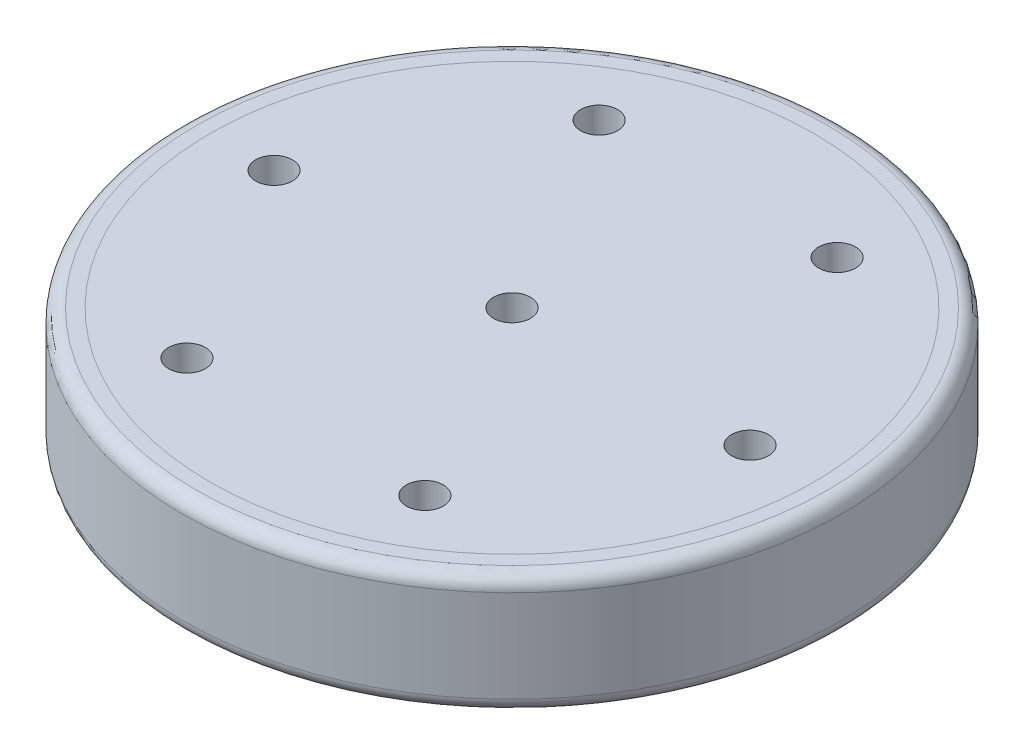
ISO-10303-21;
HEADER;
FILE_DESCRIPTION(('STEP AP214'),'2;1');
FILE_NAME('part.step','',(''),(''),'','','');
FILE_SCHEMA(('AUTOMOTIVE_DESIGN { 1 0 10303 214 1 1 1 1 }'));
ENDSEC;
DATA;
#1=APPLICATION_CONTEXT('core data for automotive mechanical design processes');
#2=APPLICATION_PROTOCOL_DEFINITION('international standard','automotive_design',2000,#1);
#3=PRODUCT_CONTEXT('',#1,'mechanical');
#4=PRODUCT('Part','Part','',(#3));
#5=PRODUCT_RELATED_PRODUCT_CATEGORY('part','',(#4));
#6=PRODUCT_DEFINITION_FORMATION('','',#4);
#7=PRODUCT_DEFINITION_CONTEXT('part definition',#1,'design');
#8=PRODUCT_DEFINITION('design','',#6,#7);
#9=PRODUCT_DEFINITION_SHAPE('','',#8);
#10=(LENGTH_UNIT() NAMED_UNIT(*) SI_UNIT(.MILLI.,.METRE.));
#11=(NAMED_UNIT(*) PLANE_ANGLE_UNIT() SI_UNIT($,.RADIAN.));
#12=(NAMED_UNIT(*) SI_UNIT($,.STERADIAN.) SOLID_ANGLE_UNIT());
#13=UNCERTAINTY_MEASURE_WITH_UNIT(LENGTH_MEASURE(1.E-05),#10,'distance_accuracy_value','');
#14=(GEOMETRIC_REPRESENTATION_CONTEXT(3) GLOBAL_UNCERTAINTY_ASSIGNED_CONTEXT((#13)) GLOBAL_UNIT_ASSIGNED_CONTEXT((#10,
#11,#12)) REPRESENTATION_CONTEXT('',''));
#15=CARTESIAN_POINT('',(0.,0.,0.));
#16=DIRECTION('',(0.,0.,1.));
#17=DIRECTION('',(1.,0.,0.));
#18=AXIS2_PLACEMENT_3D('',#15,#16,#17);
#19=CARTESIAN_POINT('',(0.,-10.,0.));
#20=DIRECTION('',(0.,1.,0.));
#21=DIRECTION('',(0.,0.,1.));
#22=AXIS2_PLACEMENT_3D('',#19,#20,#21);
#23=CYLINDRICAL_SURFACE('',#22,35.75);
#24=CARTESIAN_POINT('',(0.,-8.5,0.));
#25=DIRECTION('',(0.,1.,0.));
#26=DIRECTION('',(0.,0.,1.));
#27=AXIS2_PLACEMENT_3D('',#24,#25,#26);
#28=CIRCLE('',#27,35.75);
#29=CARTESIAN_POINT('',(0.,-8.5,35.75));
#30=VERTEX_POINT('',#29);
#31=EDGE_CURVE('E53',#30,#30,#28,.T.);
#32=CARTESIAN_POINT('',(0.,1.5,0.));
#33=DIRECTION('',(0.,1.,0.));
#34=DIRECTION('',(0.,0.,1.));
#35=AXIS2_PLACEMENT_3D('',#32,#33,#34);
#36=CIRCLE('',#35,35.75);
#37=CARTESIAN_POINT('',(0.,1.5,35.75));
#38=VERTEX_POINT('',#37);
#39=EDGE_CURVE('E57',#38,#38,#36,.F.);
#40=CARTESIAN_POINT('',(0.,-8.5,35.75));
#41=CARTESIAN_POINT('',(0.,-8.39583333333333,35.75));
#42=CARTESIAN_POINT('',(0.,-8.29166666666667,35.75));
#43=CARTESIAN_POINT('',(0.,-8.08333333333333,35.75));
#44=CARTESIAN_POINT('',(0.,-7.97916666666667,35.75));
#45=CARTESIAN_POINT('',(0.,-7.77083333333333,35.75));
#46=CARTESIAN_POINT('',(0.,-7.66666666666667,35.75));
#47=CARTESIAN_POINT('',(0.,-7.45833333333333,35.75));
#48=CARTESIAN_POINT('',(0.,-7.35416666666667,35.75));
#49=CARTESIAN_POINT('',(0.,-7.14583333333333,35.75));
#50=CARTESIAN_POINT('',(0.,-7.04166666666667,35.75));
#51=CARTESIAN_POINT('',(0.,-6.83333333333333,35.75));
#52=CARTESIAN_POINT('',(0.,-6.72916666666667,35.75));
#53=CARTESIAN_POINT('',(0.,-6.52083333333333,35.75));
#54=CARTESIAN_POINT('',(0.,-6.41666666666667,35.75));
#55=CARTESIAN_POINT('',(0.,-6.20833333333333,35.75));
#56=CARTESIAN_POINT('',(0.,-6.10416666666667,35.75));
#57=CARTESIAN_POINT('',(0.,-5.89583333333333,35.75));
#58=CARTESIAN_POINT('',(0.,-5.79166666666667,35.75));
#59=CARTESIAN_POINT('',(0.,-5.58333333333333,35.75));
#60=CARTESIAN_POINT('',(0.,-5.47916666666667,35.75));
#61=CARTESIAN_POINT('',(0.,-5.27083333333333,35.75));
#62=CARTESIAN_POINT('',(0.,-5.16666666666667,35.75));
#63=CARTESIAN_POINT('',(0.,-4.95833333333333,35.75));
#64=CARTESIAN_POINT('',(0.,-4.85416666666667,35.75));
#65=CARTESIAN_POINT('',(0.,-4.64583333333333,35.75));
#66=CARTESIAN_POINT('',(0.,-4.54166666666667,35.75));
#67=CARTESIAN_POINT('',(0.,-4.33333333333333,35.75));
#68=CARTESIAN_POINT('',(0.,-4.22916666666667,35.75));
#69=CARTESIAN_POINT('',(0.,-4.02083333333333,35.75));
#70=CARTESIAN_POINT('',(0.,-3.91666666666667,35.75));
#71=CARTESIAN_POINT('',(0.,-3.70833333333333,35.75));
#72=CARTESIAN_POINT('',(0.,-3.60416666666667,35.75));
#73=CARTESIAN_POINT('',(0.,-3.39583333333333,35.75));
#74=CARTESIAN_POINT('',(0.,-3.29166666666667,35.75));
#75=CARTESIAN_POINT('',(0.,-3.08333333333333,35.75));
#76=CARTESIAN_POINT('',(0.,-2.97916666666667,35.75));
#77=CARTESIAN_POINT('',(0.,-2.77083333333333,35.75));
#78=CARTESIAN_POINT('',(0.,-2.66666666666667,35.75));
#79=CARTESIAN_POINT('',(0.,-2.45833333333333,35.75));
#80=CARTESIAN_POINT('',(0.,-2.35416666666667,35.75));
#81=CARTESIAN_POINT('',(0.,-2.14583333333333,35.75));
#82=CARTESIAN_POINT('',(0.,-2.04166666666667,35.75));
#83=CARTESIAN_POINT('',(0.,-1.83333333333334,35.75));
#84=CARTESIAN_POINT('',(0.,-1.72916666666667,35.75));
#85=CARTESIAN_POINT('',(0.,-1.52083333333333,35.75));
#86=CARTESIAN_POINT('',(0.,-1.41666666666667,35.75));
#87=CARTESIAN_POINT('',(0.,-1.20833333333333,35.75));
#88=CARTESIAN_POINT('',(0.,-1.10416666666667,35.75));
#89=CARTESIAN_POINT('',(0.,-0.895833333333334,35.75));
#90=CARTESIAN_POINT('',(0.,-0.791666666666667,35.75));
#91=CARTESIAN_POINT('',(0.,-0.583333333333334,35.75));
#92=CARTESIAN_POINT('',(0.,-0.479166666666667,35.75));
#93=CARTESIAN_POINT('',(0.,-0.270833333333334,35.75));
#94=CARTESIAN_POINT('',(0.,-0.166666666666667,35.75));
#95=CARTESIAN_POINT('',(0.,0.0416666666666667,35.75));
#96=CARTESIAN_POINT('',(0.,0.145833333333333,35.75));
#97=CARTESIAN_POINT('',(0.,0.354166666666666,35.75));
#98=CARTESIAN_POINT('',(0.,0.458333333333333,35.75));
#99=CARTESIAN_POINT('',(0.,0.666666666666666,35.75));
#100=CARTESIAN_POINT('',(0.,0.770833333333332,35.75));
#101=CARTESIAN_POINT('',(0.,0.979166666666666,35.75));
#102=CARTESIAN_POINT('',(0.,1.08333333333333,35.75));
#103=CARTESIAN_POINT('',(0.,1.29166666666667,35.75));
#104=CARTESIAN_POINT('',(0.,1.39583333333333,35.75));
#105=CARTESIAN_POINT('',(0.,1.5,35.75));
#106=B_SPLINE_CURVE_WITH_KNOTS('',3,(#40,#41,#42,#43,#44,#45,#46,#47,#48,#49,#50,#51,#52,#53,
#54,#55,#56,#57,#58,#59,#60,#61,#62,#63,#64,#65,#66,#67,#68,#69,#70,#71,#72,#73,#74,#75,#76,#77,
#78,#79,#80,#81,#82,#83,#84,#85,#86,#87,#88,#89,#90,#91,#92,#93,#94,#95,#96,#97,#98,#99,#100,
#101,#102,#103,#104,#105),.UNSPECIFIED.,.F.,.F.,(4,2,2,2,2,2,2,2,2,2,2,2,2,2,2,2,2,2,2,2,2,2,2,
2,2,2,2,2,2,2,2,2,4),(0.,0.312499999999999,0.624999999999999,0.937499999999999,1.25,1.5625,
1.875,2.1875,2.5,2.8125,3.125,3.4375,3.75,4.0625,4.375,4.6875,5.,5.3125,5.625,5.9375,6.25,
6.5625,6.875,7.1875,7.5,7.8125,8.125,8.4375,8.75,9.0625,9.375,9.6875,10.),.UNSPECIFIED.);
#107=EDGE_CURVE('BSEAM45',#30,#38,#106,.T.);
#108=ORIENTED_EDGE('',*,*,#31,.T.);
#109=ORIENTED_EDGE('',*,*,#39,.T.);
#110=ORIENTED_EDGE('',*,*,#107,.T.);
#111=ORIENTED_EDGE('',*,*,#107,.F.);
#112=EDGE_LOOP('',(#108,#110,#109,#111));
#113=FACE_BOUND('',#112,.T.);
#114=ADVANCED_FACE('F45',(#113),#23,.T.);
#115=CARTESIAN_POINT('',(0.,3.,0.));
#116=DIRECTION('',(0.,1.,0.));
#117=DIRECTION('',(0.,0.,1.));
#118=AXIS2_PLACEMENT_3D('',#115,#116,#117);
#119=PLANE('',#118);
#120=CARTESIAN_POINT('',(0.,3.,0.));
#121=DIRECTION('',(0.,1.,0.));
#122=DIRECTION('',(0.,0.,1.));
#123=AXIS2_PLACEMENT_3D('',#120,#121,#122);
#124=CIRCLE('',#123,34.25);
#125=CARTESIAN_POINT('',(0.,3.,34.25));
#126=VERTEX_POINT('',#125);
#127=EDGE_CURVE('E12',#126,#126,#124,.T.);
#128=ORIENTED_EDGE('',*,*,#127,.T.);
#129=EDGE_LOOP('',(#128));
#130=FACE_BOUND('',#129,.T.);
#131=CARTESIAN_POINT('',(0.,3.,0.));
#132=DIRECTION('',(0.,1.,0.));
#133=DIRECTION('',(0.,0.,1.));
#134=AXIS2_PLACEMENT_3D('',#131,#132,#133);
#135=CIRCLE('',#134,32.75);
#136=CARTESIAN_POINT('',(0.,3.,32.75));
#137=VERTEX_POINT('',#136);
#138=EDGE_CURVE('E65',#137,#137,#135,.T.);
#139=ORIENTED_EDGE('',*,*,#138,.F.);
#140=EDGE_LOOP('',(#139));
#141=FACE_BOUND('',#140,.T.);
#142=ADVANCED_FACE('F85',(#130,#141),#119,.T.);
#143=CARTESIAN_POINT('',(0.,-10.,0.));
#144=DIRECTION('',(0.,1.,0.));
#145=DIRECTION('',(0.,0.,1.));
#146=AXIS2_PLACEMENT_3D('',#143,#144,#145);
#147=CYLINDRICAL_SURFACE('',#146,32.75);
#148=CARTESIAN_POINT('',(0.,-8.5,0.));
#149=DIRECTION('',(0.,1.,0.));
#150=DIRECTION('',(0.,0.,1.));
#151=AXIS2_PLACEMENT_3D('',#148,#149,#150);
#152=CIRCLE('',#151,32.75);
#153=CARTESIAN_POINT('',(0.,-8.5,32.75));
#154=VERTEX_POINT('',#153);
#155=EDGE_CURVE('E62',#154,#154,#152,.F.);
#156=CARTESIAN_POINT('',(0.,-8.5,32.75));
#157=CARTESIAN_POINT('',(0.,-8.38020833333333,32.75));
#158=CARTESIAN_POINT('',(0.,-8.26041666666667,32.75));
#159=CARTESIAN_POINT('',(0.,-8.02083333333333,32.75));
#160=CARTESIAN_POINT('',(0.,-7.90104166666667,32.75));
#161=CARTESIAN_POINT('',(0.,-7.66145833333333,32.75));
#162=CARTESIAN_POINT('',(0.,-7.54166666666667,32.75));
#163=CARTESIAN_POINT('',(0.,-7.30208333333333,32.75));
#164=CARTESIAN_POINT('',(0.,-7.18229166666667,32.75));
#165=CARTESIAN_POINT('',(0.,-6.94270833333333,32.75));
#166=CARTESIAN_POINT('',(0.,-6.82291666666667,32.75));
#167=CARTESIAN_POINT('',(0.,-6.58333333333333,32.75));
#168=CARTESIAN_POINT('',(0.,-6.46354166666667,32.75));
#169=CARTESIAN_POINT('',(0.,-6.22395833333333,32.75));
#170=CARTESIAN_POINT('',(0.,-6.10416666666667,32.75));
#171=CARTESIAN_POINT('',(0.,-5.86458333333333,32.75));
#172=CARTESIAN_POINT('',(0.,-5.74479166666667,32.75));
#173=CARTESIAN_POINT('',(0.,-5.50520833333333,32.75));
#174=CARTESIAN_POINT('',(0.,-5.38541666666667,32.75));
#175=CARTESIAN_POINT('',(0.,-5.14583333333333,32.75));
#176=CARTESIAN_POINT('',(0.,-5.02604166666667,32.75));
#177=CARTESIAN_POINT('',(0.,-4.78645833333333,32.75));
#178=CARTESIAN_POINT('',(0.,-4.66666666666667,32.75));
#179=CARTESIAN_POINT('',(0.,-4.42708333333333,32.75));
#180=CARTESIAN_POINT('',(0.,-4.30729166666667,32.75));
#181=CARTESIAN_POINT('',(0.,-4.06770833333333,32.75));
#182=CARTESIAN_POINT('',(0.,-3.94791666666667,32.75));
#183=CARTESIAN_POINT('',(0.,-3.70833333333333,32.75));
#184=CARTESIAN_POINT('',(0.,-3.58854166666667,32.75));
#185=CARTESIAN_POINT('',(0.,-3.34895833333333,32.75));
#186=CARTESIAN_POINT('',(0.,-3.22916666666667,32.75));
#187=CARTESIAN_POINT('',(0.,-2.98958333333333,32.75));
#188=CARTESIAN_POINT('',(0.,-2.86979166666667,32.75));
#189=CARTESIAN_POINT('',(0.,-2.63020833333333,32.75));
#190=CARTESIAN_POINT('',(0.,-2.51041666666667,32.75));
#191=CARTESIAN_POINT('',(0.,-2.27083333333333,32.75));
#192=CARTESIAN_POINT('',(0.,-2.15104166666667,32.75));
#193=CARTESIAN_POINT('',(0.,-1.91145833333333,32.75));
#194=CARTESIAN_POINT('',(0.,-1.79166666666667,32.75));
#195=CARTESIAN_POINT('',(0.,-1.55208333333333,32.75));
#196=CARTESIAN_POINT('',(0.,-1.43229166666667,32.75));
#197=CARTESIAN_POINT('',(0.,-1.19270833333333,32.75));
#198=CARTESIAN_POINT('',(0.,-1.07291666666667,32.75));
#199=CARTESIAN_POINT('',(0.,-0.833333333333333,32.75));
#200=CARTESIAN_POINT('',(0.,-0.713541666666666,32.75));
#201=CARTESIAN_POINT('',(0.,-0.473958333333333,32.75));
#202=CARTESIAN_POINT('',(0.,-0.354166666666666,32.75));
#203=CARTESIAN_POINT('',(0.,-0.114583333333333,32.75));
#204=CARTESIAN_POINT('',(0.,0.00520833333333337,32.75));
#205=CARTESIAN_POINT('',(0.,0.244791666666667,32.75));
#206=CARTESIAN_POINT('',(0.,0.364583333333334,32.75));
#207=CARTESIAN_POINT('',(0.,0.604166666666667,32.75));
#208=CARTESIAN_POINT('',(0.,0.723958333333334,32.75));
#209=CARTESIAN_POINT('',(0.,0.963541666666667,32.75));
#210=CARTESIAN_POINT('',(0.,1.08333333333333,32.75));
#211=CARTESIAN_POINT('',(0.,1.32291666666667,32.75));
#212=CARTESIAN_POINT('',(0.,1.44270833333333,32.75));
#213=CARTESIAN_POINT('',(0.,1.68229166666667,32.75));
#214=CARTESIAN_POINT('',(0.,1.80208333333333,32.75));
#215=CARTESIAN_POINT('',(0.,2.04166666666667,32.75));
#216=CARTESIAN_POINT('',(0.,2.16145833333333,32.75));
#217=CARTESIAN_POINT('',(0.,2.40104166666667,32.75));
#218=CARTESIAN_POINT('',(0.,2.52083333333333,32.75));
#219=CARTESIAN_POINT('',(0.,2.76041666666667,32.75));
#220=CARTESIAN_POINT('',(0.,2.88020833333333,32.75));
#221=CARTESIAN_POINT('',(0.,3.,32.75));
#222=B_SPLINE_CURVE_WITH_KNOTS('',3,(#156,#157,#158,#159,#160,#161,#162,#163,#164,#165,#166,
#167,#168,#169,#170,#171,#172,#173,#174,#175,#176,#177,#178,#179,#180,#181,#182,#183,#184,#185,
#186,#187,#188,#189,#190,#191,#192,#193,#194,#195,#196,#197,#198,#199,#200,#201,#202,#203,#204,
#205,#206,#207,#208,#209,#210,#211,#212,#213,#214,#215,#216,#217,#218,#219,#220,#221),
.UNSPECIFIED.,.F.,.F.,(4,2,2,2,2,2,2,2,2,2,2,2,2,2,2,2,2,2,2,2,2,2,2,2,2,2,2,2,2,2,2,2,4),(0.,
0.359375,0.718749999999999,1.078125,1.4375,1.796875,2.15625,2.515625,2.875,3.234375,3.59375,
3.953125,4.3125,4.671875,5.03125,5.390625,5.75,6.109375,6.46875,6.828125,7.1875,7.546875,
7.90625,8.265625,8.625,8.984375,9.34375,9.703125,10.0625,10.421875,10.78125,11.140625,11.5),.UNSPECIFIED.);
#223=EDGE_CURVE('BSEAM76',#154,#137,#222,.T.);
#224=ORIENTED_EDGE('',*,*,#155,.T.);
#225=ORIENTED_EDGE('',*,*,#138,.T.);
#226=ORIENTED_EDGE('',*,*,#223,.T.);
#227=ORIENTED_EDGE('',*,*,#223,.F.);
#228=EDGE_LOOP('',(#224,#226,#225,#227));
#229=FACE_BOUND('',#228,.T.);
#230=ADVANCED_FACE('F76',(#229),#147,.F.);
#231=CARTESIAN_POINT('',(0.,-8.5,0.));
#232=DIRECTION('',(0.,1.,0.));
#233=DIRECTION('',(0.,0.,1.));
#234=AXIS2_PLACEMENT_3D('',#231,#232,#233);
#235=TOROIDAL_SURFACE('',#234,34.25,1.5);
#236=ORIENTED_EDGE('',*,*,#31,.F.);
#237=EDGE_LOOP('',(#236));
#238=FACE_BOUND('',#237,.T.);
#239=CARTESIAN_POINT('',(0.,-10.,0.));
#240=DIRECTION('',(0.,1.,0.));
#241=DIRECTION('',(0.,0.,1.));
#242=AXIS2_PLACEMENT_3D('',#239,#240,#241);
#243=CIRCLE('',#242,34.25);
#244=CARTESIAN_POINT('',(0.,-10.,34.25));
#245=VERTEX_POINT('',#244);
#246=EDGE_CURVE('E49',#245,#245,#243,.F.);
#247=ORIENTED_EDGE('',*,*,#246,.F.);
#248=EDGE_LOOP('',(#247));
#249=FACE_BOUND('',#248,.T.);
#250=ADVANCED_FACE('F74',(#238,#249),#235,.T.);
#251=CARTESIAN_POINT('',(0.,-8.5,0.));
#252=DIRECTION('',(0.,1.,0.));
#253=DIRECTION('',(0.,0.,1.));
#254=AXIS2_PLACEMENT_3D('',#251,#252,#253);
#255=TOROIDAL_SURFACE('',#254,34.25,1.5);
#256=ORIENTED_EDGE('',*,*,#155,.F.);
#257=EDGE_LOOP('',(#256));
#258=FACE_BOUND('',#257,.T.);
#259=ORIENTED_EDGE('',*,*,#246,.T.);
#260=EDGE_LOOP('',(#259));
#261=FACE_BOUND('',#260,.T.);
#262=ADVANCED_FACE('F72',(#258,#261),#255,.T.);
#263=CARTESIAN_POINT('',(0.,1.5,0.));
#264=DIRECTION('',(0.,1.,0.));
#265=DIRECTION('',(0.,0.,1.));
#266=AXIS2_PLACEMENT_3D('',#263,#264,#265);
#267=TOROIDAL_SURFACE('',#266,34.25,1.5);
#268=ORIENTED_EDGE('',*,*,#39,.F.);
#269=EDGE_LOOP('',(#268));
#270=FACE_BOUND('',#269,.T.);
#271=ORIENTED_EDGE('',*,*,#127,.F.);
#272=EDGE_LOOP('',(#271));
#273=FACE_BOUND('',#272,.T.);
#274=ADVANCED_FACE('F47',(#270,#273),#267,.T.);
#275=CLOSED_SHELL('',(#114,#142,#230,#250,#262,#274));
#276=MANIFOLD_SOLID_BREP('B2',#275);
#277=CARTESIAN_POINT('',(0.,3.,0.));
#278=DIRECTION('',(0.,1.,0.));
#279=DIRECTION('',(0.,0.,1.));
#280=AXIS2_PLACEMENT_3D('',#277,#278,#279);
#281=PLANE('',#280);
#282=CARTESIAN_POINT('',(12.907029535,3.,22.3556309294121));
#283=DIRECTION('',(0.,1.,0.));
#284=DIRECTION('',(0.,0.,1.));
#285=AXIS2_PLACEMENT_3D('',#282,#283,#284);
#286=CIRCLE('',#285,2.00000000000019);
#287=CARTESIAN_POINT('',(12.907029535,3.,24.3556309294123));
#288=VERTEX_POINT('',#287);
#289=EDGE_CURVE('E184',#288,#288,#286,.T.);
#290=ORIENTED_EDGE('',*,*,#289,.F.);
#291=EDGE_LOOP('',(#290));
#292=FACE_BOUND('',#291,.T.);
#293=CARTESIAN_POINT('',(-12.907029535,3.,-22.3556309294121));
#294=DIRECTION('',(0.,1.,0.));
#295=DIRECTION('',(0.,0.,1.));
#296=AXIS2_PLACEMENT_3D('',#293,#294,#295);
#297=CIRCLE('',#296,1.99999999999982);
#298=CARTESIAN_POINT('',(-12.907029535,3.,-20.3556309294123));
#299=VERTEX_POINT('',#298);
#300=EDGE_CURVE('E164',#299,#299,#297,.F.);
#301=ORIENTED_EDGE('',*,*,#300,.T.);
#302=EDGE_LOOP('',(#301));
#303=FACE_BOUND('',#302,.T.);
#304=CARTESIAN_POINT('',(0.,3.,0.));
#305=DIRECTION('',(0.,1.,0.));
#306=DIRECTION('',(0.,0.,1.));
#307=AXIS2_PLACEMENT_3D('',#304,#305,#306);
#308=CIRCLE('',#307,32.75);
#309=CARTESIAN_POINT('',(0.,3.,32.75));
#310=VERTEX_POINT('',#309);
#311=EDGE_CURVE('E44',#310,#310,#308,.T.);
#312=ORIENTED_EDGE('',*,*,#311,.T.);
#313=EDGE_LOOP('',(#312));
#314=FACE_BOUND('',#313,.T.);
#315=CARTESIAN_POINT('',(0.,3.,0.));
#316=DIRECTION('',(0.,1.,0.));
#317=DIRECTION('',(0.,0.,1.));
#318=AXIS2_PLACEMENT_3D('',#315,#316,#317);
#319=CIRCLE('',#318,2.);
#320=CARTESIAN_POINT('',(0.,3.,2.));
#321=VERTEX_POINT('',#320);
#322=EDGE_CURVE('E152',#321,#321,#319,.T.);
#323=ORIENTED_EDGE('',*,*,#322,.F.);
#324=EDGE_LOOP('',(#323));
#325=FACE_BOUND('',#324,.T.);
#326=CARTESIAN_POINT('',(-25.81405907,3.,0.));
#327=DIRECTION('',(0.,1.,0.));
#328=DIRECTION('',(0.,0.,1.));
#329=AXIS2_PLACEMENT_3D('',#326,#327,#328);
#330=CIRCLE('',#329,2.);
#331=CARTESIAN_POINT('',(-25.81405907,3.,2.));
#332=VERTEX_POINT('',#331);
#333=EDGE_CURVE('E160',#332,#332,#330,.F.);
#334=ORIENTED_EDGE('',*,*,#333,.T.);
#335=EDGE_LOOP('',(#334));
#336=FACE_BOUND('',#335,.T.);
#337=CARTESIAN_POINT('',(12.907029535,3.,-22.3556309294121));
#338=DIRECTION('',(0.,1.,0.));
#339=DIRECTION('',(0.,0.,1.));
#340=AXIS2_PLACEMENT_3D('',#337,#338,#339);
#341=CIRCLE('',#340,2.00000000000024);
#342=CARTESIAN_POINT('',(12.907029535,3.,-20.3556309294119));
#343=VERTEX_POINT('',#342);
#344=EDGE_CURVE('E168',#343,#343,#341,.T.);
#345=ORIENTED_EDGE('',*,*,#344,.F.);
#346=EDGE_LOOP('',(#345));
#347=FACE_BOUND('',#346,.T.);
#348=CARTESIAN_POINT('',(25.81405907,3.,0.));
#349=DIRECTION('',(0.,1.,0.));
#350=DIRECTION('',(0.,0.,1.));
#351=AXIS2_PLACEMENT_3D('',#348,#349,#350);
#352=CIRCLE('',#351,2.);
#353=CARTESIAN_POINT('',(25.81405907,3.,1.99999999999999));
#354=VERTEX_POINT('',#353);
#355=EDGE_CURVE('E171',#354,#354,#352,.T.);
#356=ORIENTED_EDGE('',*,*,#355,.F.);
#357=EDGE_LOOP('',(#356));
#358=FACE_BOUND('',#357,.T.);
#359=CARTESIAN_POINT('',(-12.907029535,3.,22.3556309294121));
#360=DIRECTION('',(0.,1.,0.));
#361=DIRECTION('',(0.,0.,1.));
#362=AXIS2_PLACEMENT_3D('',#359,#360,#361);
#363=CIRCLE('',#362,1.99999999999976);
#364=CARTESIAN_POINT('',(-12.907029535,3.,24.3556309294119));
#365=VERTEX_POINT('',#364);
#366=EDGE_CURVE('E174',#365,#365,#363,.F.);
#367=ORIENTED_EDGE('',*,*,#366,.T.);
#368=EDGE_LOOP('',(#367));
#369=FACE_BOUND('',#368,.T.);
#370=ADVANCED_FACE('F136',(#292,#303,#314,#325,#336,#347,#358,#369),#281,.T.);
#371=CARTESIAN_POINT('',(0.,0.,0.));
#372=DIRECTION('',(0.,1.,0.));
#373=DIRECTION('',(0.,0.,1.));
#374=AXIS2_PLACEMENT_3D('',#371,#372,#373);
#375=PLANE('',#374);
#376=CARTESIAN_POINT('',(12.907029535,0.,22.3556309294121));
#377=DIRECTION('',(0.,1.,0.));
#378=DIRECTION('',(0.,0.,1.));
#379=AXIS2_PLACEMENT_3D('',#376,#377,#378);
#380=CIRCLE('',#379,2.00000000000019);
#381=CARTESIAN_POINT('',(12.907029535,0.,24.3556309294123));
#382=VERTEX_POINT('',#381);
#383=EDGE_CURVE('E140',#382,#382,#380,.T.);
#384=ORIENTED_EDGE('',*,*,#383,.T.);
#385=EDGE_LOOP('',(#384));
#386=FACE_BOUND('',#385,.T.);
#387=CARTESIAN_POINT('',(-12.907029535,0.,-22.3556309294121));
#388=DIRECTION('',(0.,1.,0.));
#389=DIRECTION('',(0.,0.,1.));
#390=AXIS2_PLACEMENT_3D('',#387,#388,#389);
#391=CIRCLE('',#390,1.99999999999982);
#392=CARTESIAN_POINT('',(-12.907029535,0.,-20.3556309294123));
#393=VERTEX_POINT('',#392);
#394=EDGE_CURVE('E161',#393,#393,#391,.F.);
#395=ORIENTED_EDGE('',*,*,#394,.F.);
#396=EDGE_LOOP('',(#395));
#397=FACE_BOUND('',#396,.T.);
#398=CARTESIAN_POINT('',(0.,0.,0.));
#399=DIRECTION('',(0.,1.,0.));
#400=DIRECTION('',(0.,0.,1.));
#401=AXIS2_PLACEMENT_3D('',#398,#399,#400);
#402=CIRCLE('',#401,32.75);
#403=CARTESIAN_POINT('',(0.,0.,32.75));
#404=VERTEX_POINT('',#403);
#405=EDGE_CURVE('E144',#404,#404,#402,.T.);
#406=ORIENTED_EDGE('',*,*,#405,.F.);
#407=EDGE_LOOP('',(#406));
#408=FACE_BOUND('',#407,.T.);
#409=CARTESIAN_POINT('',(0.,0.,0.));
#410=DIRECTION('',(0.,1.,0.));
#411=DIRECTION('',(0.,0.,1.));
#412=AXIS2_PLACEMENT_3D('',#409,#410,#411);
#413=CIRCLE('',#412,2.);
#414=CARTESIAN_POINT('',(0.,0.,2.));
#415=VERTEX_POINT('',#414);
#416=EDGE_CURVE('E149',#415,#415,#413,.T.);
#417=ORIENTED_EDGE('',*,*,#416,.T.);
#418=EDGE_LOOP('',(#417));
#419=FACE_BOUND('',#418,.T.);
#420=CARTESIAN_POINT('',(-25.81405907,0.,0.));
#421=DIRECTION('',(0.,1.,0.));
#422=DIRECTION('',(0.,0.,1.));
#423=AXIS2_PLACEMENT_3D('',#420,#421,#422);
#424=CIRCLE('',#423,2.);
#425=CARTESIAN_POINT('',(-25.81405907,0.,2.));
#426=VERTEX_POINT('',#425);
#427=EDGE_CURVE('E157',#426,#426,#424,.F.);
#428=ORIENTED_EDGE('',*,*,#427,.F.);
#429=EDGE_LOOP('',(#428));
#430=FACE_BOUND('',#429,.T.);
#431=CARTESIAN_POINT('',(12.907029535,0.,-22.3556309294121));
#432=DIRECTION('',(0.,1.,0.));
#433=DIRECTION('',(0.,0.,1.));
#434=AXIS2_PLACEMENT_3D('',#431,#432,#433);
#435=CIRCLE('',#434,2.00000000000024);
#436=CARTESIAN_POINT('',(12.907029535,0.,-20.3556309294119));
#437=VERTEX_POINT('',#436);
#438=EDGE_CURVE('E165',#437,#437,#435,.T.);
#439=ORIENTED_EDGE('',*,*,#438,.T.);
#440=EDGE_LOOP('',(#439));
#441=FACE_BOUND('',#440,.T.);
#442=CARTESIAN_POINT('',(25.81405907,0.,0.));
#443=DIRECTION('',(0.,1.,0.));
#444=DIRECTION('',(0.,0.,1.));
#445=AXIS2_PLACEMENT_3D('',#442,#443,#444);
#446=CIRCLE('',#445,2.);
#447=CARTESIAN_POINT('',(25.81405907,0.,1.99999999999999));
#448=VERTEX_POINT('',#447);
#449=EDGE_CURVE('E169',#448,#448,#446,.T.);
#450=ORIENTED_EDGE('',*,*,#449,.T.);
#451=EDGE_LOOP('',(#450));
#452=FACE_BOUND('',#451,.T.);
#453=CARTESIAN_POINT('',(-12.907029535,0.,22.3556309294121));
#454=DIRECTION('',(0.,1.,0.));
#455=DIRECTION('',(0.,0.,1.));
#456=AXIS2_PLACEMENT_3D('',#453,#454,#455);
#457=CIRCLE('',#456,1.99999999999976);
#458=CARTESIAN_POINT('',(-12.907029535,0.,24.3556309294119));
#459=VERTEX_POINT('',#458);
#460=EDGE_CURVE('E172',#459,#459,#457,.F.);
#461=ORIENTED_EDGE('',*,*,#460,.F.);
#462=EDGE_LOOP('',(#461));
#463=FACE_BOUND('',#462,.T.);
#464=ADVANCED_FACE('F203',(#386,#397,#408,#419,#430,#441,#452,#463),#375,.F.);
#465=CARTESIAN_POINT('',(0.,3.,0.));
#466=DIRECTION('',(0.,-1.,0.));
#467=DIRECTION('',(0.,0.,-1.));
#468=AXIS2_PLACEMENT_3D('',#465,#466,#467);
#469=CYLINDRICAL_SURFACE('',#468,32.75);
#470=ORIENTED_EDGE('',*,*,#311,.F.);
#471=EDGE_LOOP('',(#470));
#472=FACE_BOUND('',#471,.T.);
#473=ORIENTED_EDGE('',*,*,#405,.T.);
#474=EDGE_LOOP('',(#473));
#475=FACE_BOUND('',#474,.T.);
#476=ADVANCED_FACE('F138',(#472,#475),#469,.T.);
#477=CARTESIAN_POINT('',(0.,-1.,0.));
#478=DIRECTION('',(0.,1.,0.));
#479=DIRECTION('',(0.,0.,1.));
#480=AXIS2_PLACEMENT_3D('',#477,#478,#479);
#481=CYLINDRICAL_SURFACE('',#480,2.);
#482=ORIENTED_EDGE('',*,*,#322,.T.);
#483=EDGE_LOOP('',(#482));
#484=FACE_BOUND('',#483,.T.);
#485=ORIENTED_EDGE('',*,*,#416,.F.);
#486=EDGE_LOOP('',(#485));
#487=FACE_BOUND('',#486,.T.);
#488=ADVANCED_FACE('F199',(#484,#487),#481,.F.);
#489=CARTESIAN_POINT('',(-25.81405907,-7.,0.));
#490=DIRECTION('',(0.,1.,0.));
#491=DIRECTION('',(0.,0.,1.));
#492=AXIS2_PLACEMENT_3D('',#489,#490,#491);
#493=CYLINDRICAL_SURFACE('',#492,2.);
#494=ORIENTED_EDGE('',*,*,#333,.F.);
#495=EDGE_LOOP('',(#494));
#496=FACE_BOUND('',#495,.T.);
#497=ORIENTED_EDGE('',*,*,#427,.T.);
#498=EDGE_LOOP('',(#497));
#499=FACE_BOUND('',#498,.T.);
#500=ADVANCED_FACE('F195',(#496,#499),#493,.F.);
#501=CARTESIAN_POINT('',(-12.907029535,-7.,-22.3556309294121));
#502=DIRECTION('',(0.,1.,0.));
#503=DIRECTION('',(0.,0.,1.));
#504=AXIS2_PLACEMENT_3D('',#501,#502,#503);
#505=CYLINDRICAL_SURFACE('',#504,1.99999999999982);
#506=ORIENTED_EDGE('',*,*,#300,.F.);
#507=EDGE_LOOP('',(#506));
#508=FACE_BOUND('',#507,.T.);
#509=ORIENTED_EDGE('',*,*,#394,.T.);
#510=EDGE_LOOP('',(#509));
#511=FACE_BOUND('',#510,.T.);
#512=ADVANCED_FACE('F198',(#508,#511),#505,.F.);
#513=CARTESIAN_POINT('',(12.907029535,-7.,-22.3556309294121));
#514=DIRECTION('',(0.,1.,0.));
#515=DIRECTION('',(0.,0.,1.));
#516=AXIS2_PLACEMENT_3D('',#513,#514,#515);
#517=CYLINDRICAL_SURFACE('',#516,2.00000000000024);
#518=ORIENTED_EDGE('',*,*,#344,.T.);
#519=EDGE_LOOP('',(#518));
#520=FACE_BOUND('',#519,.T.);
#521=ORIENTED_EDGE('',*,*,#438,.F.);
#522=EDGE_LOOP('',(#521));
#523=FACE_BOUND('',#522,.T.);
#524=ADVANCED_FACE('F215',(#520,#523),#517,.F.);
#525=CARTESIAN_POINT('',(25.81405907,-7.,0.));
#526=DIRECTION('',(0.,1.,0.));
#527=DIRECTION('',(0.,0.,1.));
#528=AXIS2_PLACEMENT_3D('',#525,#526,#527);
#529=CYLINDRICAL_SURFACE('',#528,2.);
#530=ORIENTED_EDGE('',*,*,#355,.T.);
#531=EDGE_LOOP('',(#530));
#532=FACE_BOUND('',#531,.T.);
#533=ORIENTED_EDGE('',*,*,#449,.F.);
#534=EDGE_LOOP('',(#533));
#535=FACE_BOUND('',#534,.T.);
#536=ADVANCED_FACE('F212',(#532,#535),#529,.F.);
#537=CARTESIAN_POINT('',(-12.907029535,-7.,22.3556309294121));
#538=DIRECTION('',(0.,1.,0.));
#539=DIRECTION('',(0.,0.,1.));
#540=AXIS2_PLACEMENT_3D('',#537,#538,#539);
#541=CYLINDRICAL_SURFACE('',#540,1.99999999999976);
#542=ORIENTED_EDGE('',*,*,#366,.F.);
#543=EDGE_LOOP('',(#542));
#544=FACE_BOUND('',#543,.T.);
#545=ORIENTED_EDGE('',*,*,#460,.T.);
#546=EDGE_LOOP('',(#545));
#547=FACE_BOUND('',#546,.T.);
#548=ADVANCED_FACE('F214',(#544,#547),#541,.F.);
#549=CARTESIAN_POINT('',(12.907029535,-7.,22.3556309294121));
#550=DIRECTION('',(0.,1.,0.));
#551=DIRECTION('',(0.,0.,1.));
#552=AXIS2_PLACEMENT_3D('',#549,#550,#551);
#553=CYLINDRICAL_SURFACE('',#552,2.00000000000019);
#554=ORIENTED_EDGE('',*,*,#289,.T.);
#555=EDGE_LOOP('',(#554));
#556=FACE_BOUND('',#555,.T.);
#557=ORIENTED_EDGE('',*,*,#383,.F.);
#558=EDGE_LOOP('',(#557));
#559=FACE_BOUND('',#558,.T.);
#560=ADVANCED_FACE('F222',(#556,#559),#553,.F.);
#561=CLOSED_SHELL('',(#370,#464,#476,#488,#500,#512,#524,#536,#548,#560));
#562=MANIFOLD_SOLID_BREP('B7',#561);
#563=ADVANCED_BREP_SHAPE_REPRESENTATION('',(#18,#276,#562),#14);
#564=SHAPE_DEFINITION_REPRESENTATION(#9,#563);
ENDSEC;
END-ISO-10303-21;
